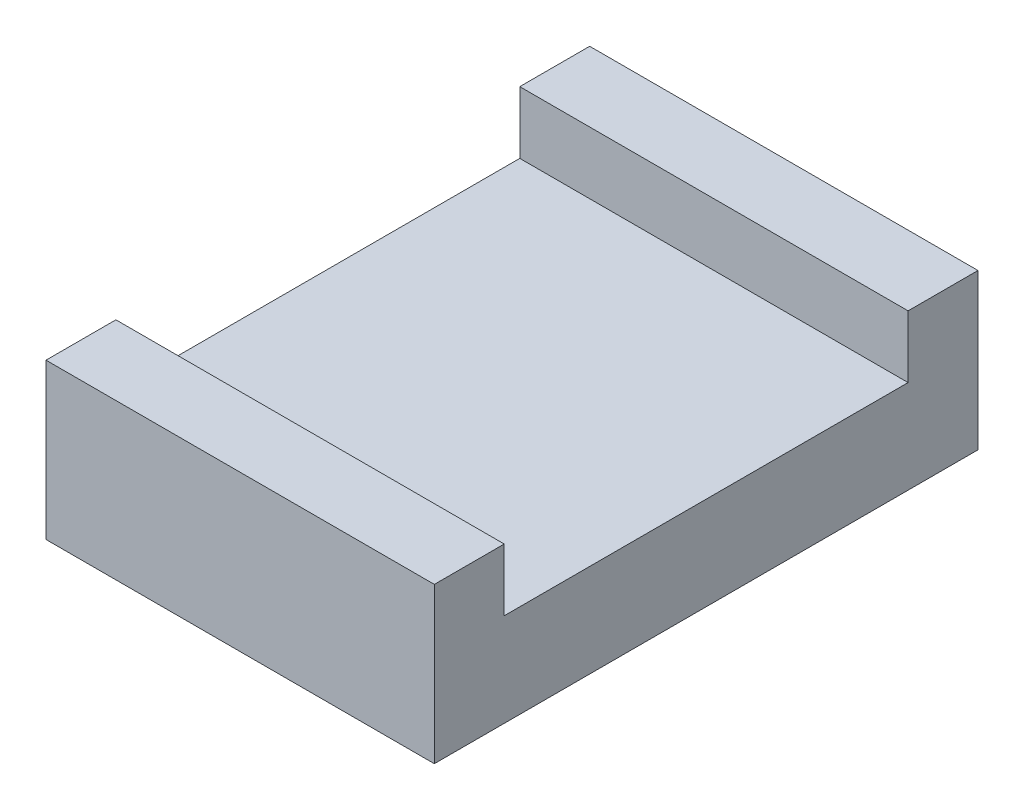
from build123d import *

# Parameters (mm, degrees)
BOSS_EXTRUDE1_DEPTH = 25


with BuildPart() as part:
    # Sketch1 → Boss-Extrude1 (new, symmetric)
    with BuildSketch(Plane(origin=(0, 0, 0), x_dir=(0, 0, -1), z_dir=(1, 0, 0))):
        Polygon((-35, 0), (35, 0), (35, 20), (26, 20), (26, 12), (-26, 12), (-26, 20), (-35, 20), align=None)
    extrude(amount=BOSS_EXTRUDE1_DEPTH, both=True)


solid = part.part
